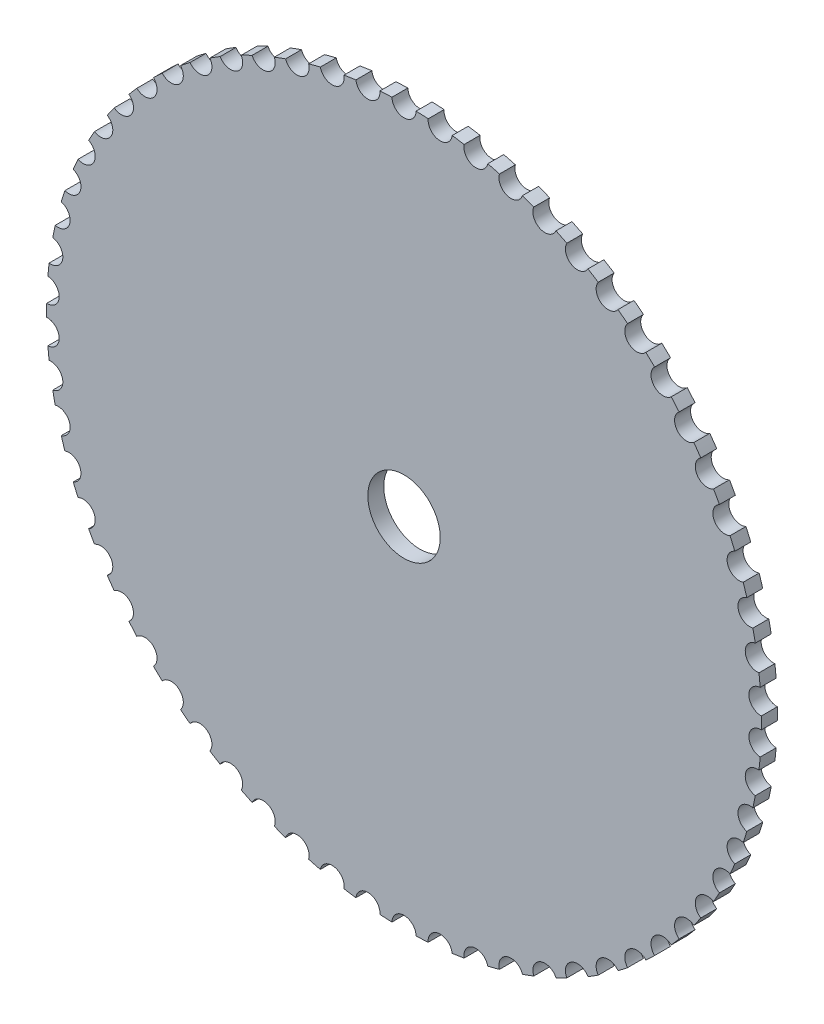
from build123d import *

# Parameters (mm, degrees)
SKETCH1_R         = 93.98
SKETCH1_R_2       = 9.525
EXTRUDE1_DEPTH    = 2.0955
EXTRUDE2_REACH    = 134.974
CIRPATTERN1_COUNT = 62


with BuildPart() as part:
    # Sketch1 → Extrude1 (new, symmetric)
    with BuildSketch(Plane.XY):
        Circle(SKETCH1_R)
        Circle(SKETCH1_R_2, mode=Mode.SUBTRACT)
    extrude(amount=EXTRUDE1_DEPTH, both=True)

    # Sketch2 → Extrude2 (cut, up to next)
    with BuildSketch(Plane(origin=(0, 0, -2.0955), x_dir=(-1, 0, 0), z_dir=(0, 0, -1)), mode=Mode.PRIVATE) as extrude2_sk1:
        with BuildLine():
            ThreePointArc((-3.174546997, 93.926368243), (0, 90.805), (3.174546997, 93.926368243))
            ThreePointArc((3.174546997, 93.926368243), (0, 93.98), (-3.174546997, 93.926368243))
        make_face()
    extrude2_tool1 = extrude(extrude2_sk1.sketch, amount=-EXTRUDE2_REACH, mode=Mode.PRIVATE) & part.part
    extrude2 = extrude2_tool1.solids().sort_by_distance((0, 92.622874, -2.0955))[0]
    add(extrude2, mode=Mode.SUBTRACT)

    # CirPattern1: Extrude2 ×62 about axis
    cirpattern1_axis = Axis((0, 0, 0), (0, 0, 1))
    for i in range(1, CIRPATTERN1_COUNT):
        add(extrude2.rotate(cirpattern1_axis, i * 360 / CIRPATTERN1_COUNT), mode=Mode.SUBTRACT)


solid = part.part
